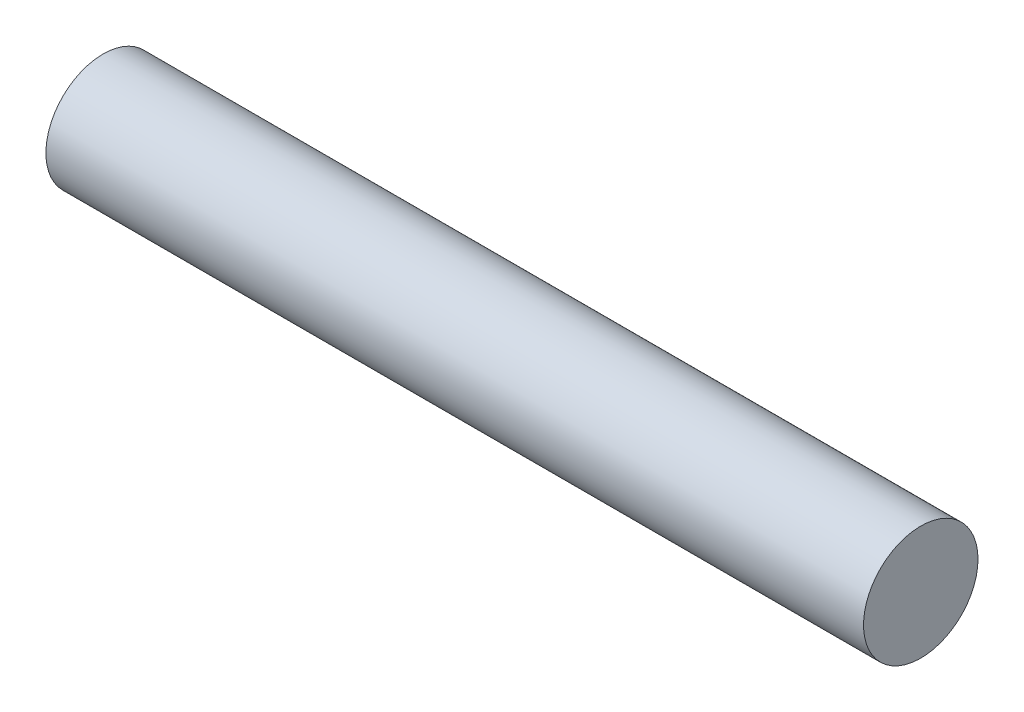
from build123d import *

# Parameters (mm, degrees)
SKETCH1_R  = 21
BASE_DEPTH = 300


with BuildPart() as part:
    # Sketch1 → Base (new body)
    with BuildSketch(Plane(origin=(0, 0, 0), x_dir=(0, 0, -1), z_dir=(1, 0, 0))):
        Circle(SKETCH1_R)
    extrude(amount=BASE_DEPTH)


solid = part.part
